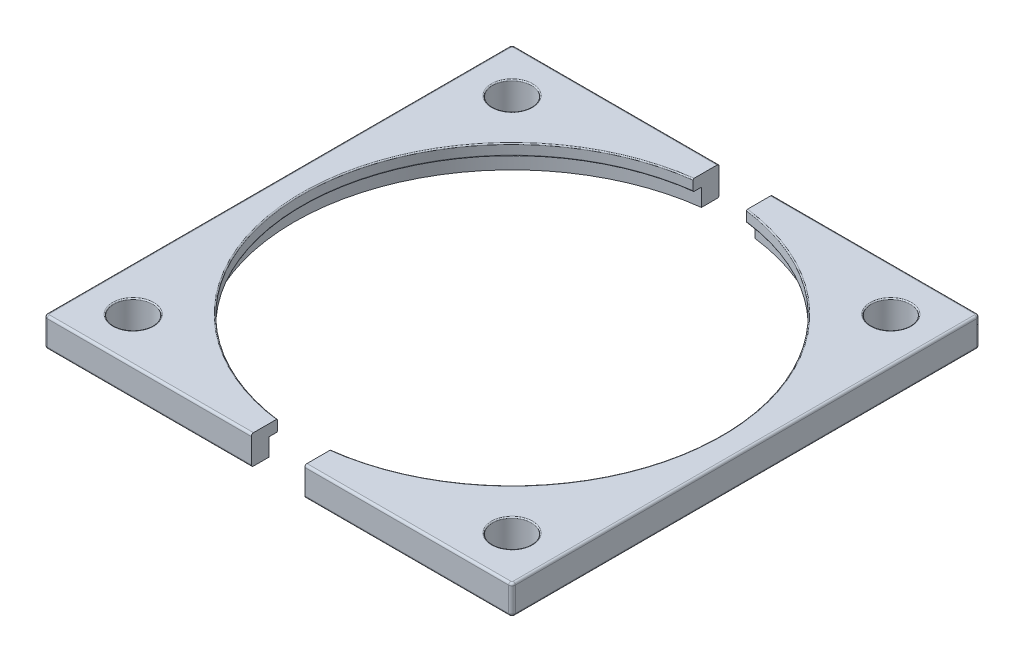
from build123d import *

# Parameters (mm, degrees)
SKETCH1_R             = 8.75
BOSS_EXTRUDE1_DEPTH   = 13
BOSS_EXTRUDE1_2_DEPTH = 13
SKETCH2_R             = 97.75
CUT_EXTRUDE1_DEPTH    = 7.9
FILLET1_R             = 0.5
FILLET2_R             = 0.5
FILLET3_R             = 1
FILLET4_R             = 1


with BuildPart() as part:
    # Sketch1 → Boss-Extrude1 (new body)
    with BuildSketch(Plane(origin=(0, 0, 0), x_dir=(1, 0, 0), z_dir=(0, 1, 0))):
        with BuildLine():
            Line((-12, 105), (-12, 93.230896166))
            ThreePointArc((-12, 93.230896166), (-94, 0), (-12, -93.230896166))
            Line((-12, -93.230896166), (-12, -105))
            Line((-12, -105), (-103.5, -105))
            ThreePointArc((-103.5, -105), (-104.560660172, -104.560660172), (-105, -103.5))
            Line((-105, -103.5), (-105, 103.5))
            ThreePointArc((-105, 103.5), (-104.560660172, 104.560660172), (-103.5, 105))
            Line((-103.5, 105), (-12, 105))
        make_face()
        with Locations(Location((-85, 85, 0), (0, 0, 90))):
            Circle(SKETCH1_R, mode=Mode.SUBTRACT)
        with Locations(Location((-85, -85, 0), (0, 0, 90))):
            Circle(SKETCH1_R, mode=Mode.SUBTRACT)
    extrude(amount=BOSS_EXTRUDE1_DEPTH)


with BuildPart() as body_2:
    # Sketch1 → Boss-Extrude1 2 (new body)
    with BuildSketch(Plane(origin=(0, 0, 0), x_dir=(1, 0, 0), z_dir=(0, 1, 0))):
        with BuildLine():
            Line((105, 103.5), (105, -103.5))
            ThreePointArc((105, -103.5), (104.560660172, -104.560660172), (103.5, -105))
            Line((103.5, -105), (12, -105))
            Line((12, -105), (12, -93.230896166))
            ThreePointArc((12, -93.230896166), (94, 0), (12, 93.230896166))
            Line((12, 93.230896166), (12, 105))
            Line((12, 105), (103.5, 105))
            ThreePointArc((103.5, 105), (104.560660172, 104.560660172), (105, 103.5))
        make_face()
        with Locations(Location((85, 85, 0), (0, 0, 90))):
            Circle(SKETCH1_R, mode=Mode.SUBTRACT)
        with Locations(Location((85, -85, 0), (0, 0, 90))):
            Circle(SKETCH1_R, mode=Mode.SUBTRACT)
    extrude(amount=BOSS_EXTRUDE1_2_DEPTH)


with BuildPart() as cut_extrude1_tool:
    # Sketch2 → Cut-Extrude1 (new body)
    with BuildSketch(Plane.XZ):
        Circle(SKETCH2_R)
    extrude(amount=-CUT_EXTRUDE1_DEPTH)


with BuildPart() as part_1:
    add(part.part)

    # Cut-Extrude1: cut by cut_extrude1_tool
    add(cut_extrude1_tool.part, mode=Mode.SUBTRACT)

    # Fillet1
    fillet1_edges = [part_1.edges().sort_by_distance(p)[0] for p in [
        (-94, 13, 0),
        (-85, 13, -76.25),
        (-85, 13, 93.75),
        (-94, 7.9, 0),
    ]]
    fillet(fillet1_edges, radius=FILLET1_R)

    # Fillet3
    fillet3_edges = [part_1.edges().sort_by_distance(p)[0] for p in [
        (-57.75, 0, 105),
        (-104.560660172, 0, 104.560660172),
        (-57.75, 13, -105),
        (-104.560660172, 13, -104.560660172),
        (-105, 13, 0),
        (-104.560660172, 13, 104.560660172),
        (-57.75, 13, 105),
        (-105, 0, 0),
        (-104.560660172, 0, -104.560660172),
        (-57.75, 0, -105),
    ]]
    fillet(fillet3_edges, radius=FILLET3_R)


with BuildPart() as body_2_1:
    add(body_2.part)

    # Cut-Extrude1: cut by cut_extrude1_tool
    add(cut_extrude1_tool.part, mode=Mode.SUBTRACT)

    # Fillet2
    fillet2_edges = [body_2_1.edges().sort_by_distance(p)[0] for p in [
        (85, 13, -76.25),
        (85, 13, 93.75),
        (94, 7.9, 0),
        (94, 13, 0),
    ]]
    fillet(fillet2_edges, radius=FILLET2_R)

    # Fillet4
    fillet4_edges = [body_2_1.edges().sort_by_distance(p)[0] for p in [
        (57.75, 13, 105),
        (104.560660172, 13, 104.560660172),
        (105, 13, 0),
        (104.560660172, 13, -104.560660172),
        (57.75, 13, -105),
        (57.75, 0, -105),
        (104.560660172, 0, -104.560660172),
        (105, 0, 0),
        (104.560660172, 0, 104.560660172),
        (57.75, 0, 105),
    ]]
    fillet(fillet4_edges, radius=FILLET4_R)


solid = Compound([part_1.part, body_2_1.part])
